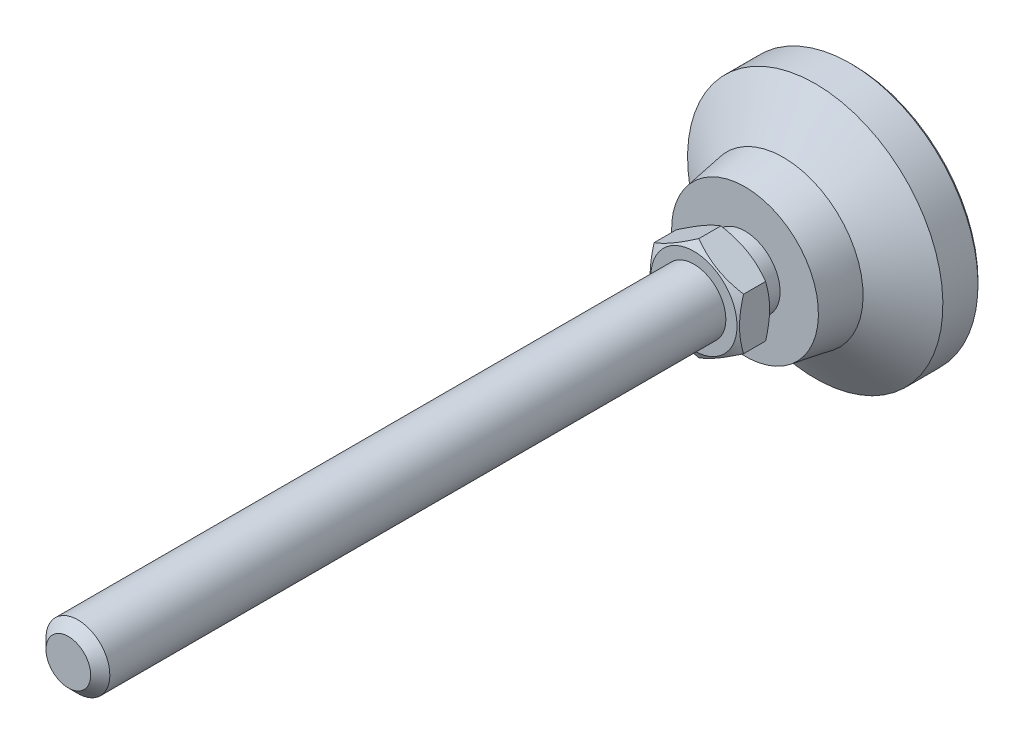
ISO-10303-21;
HEADER;
FILE_DESCRIPTION(('STEP AP214'),'2;1');
FILE_NAME('part.step','',(''),(''),'','','');
FILE_SCHEMA(('AUTOMOTIVE_DESIGN { 1 0 10303 214 1 1 1 1 }'));
ENDSEC;
DATA;
#1=APPLICATION_CONTEXT('core data for automotive mechanical design processes');
#2=APPLICATION_PROTOCOL_DEFINITION('international standard','automotive_design',2000,#1);
#3=PRODUCT_CONTEXT('',#1,'mechanical');
#4=PRODUCT('Part','Part','',(#3));
#5=PRODUCT_RELATED_PRODUCT_CATEGORY('part','',(#4));
#6=PRODUCT_DEFINITION_FORMATION('','',#4);
#7=PRODUCT_DEFINITION_CONTEXT('part definition',#1,'design');
#8=PRODUCT_DEFINITION('design','',#6,#7);
#9=PRODUCT_DEFINITION_SHAPE('','',#8);
#10=(LENGTH_UNIT() NAMED_UNIT(*) SI_UNIT(.MILLI.,.METRE.));
#11=(NAMED_UNIT(*) PLANE_ANGLE_UNIT() SI_UNIT($,.RADIAN.));
#12=(NAMED_UNIT(*) SI_UNIT($,.STERADIAN.) SOLID_ANGLE_UNIT());
#13=UNCERTAINTY_MEASURE_WITH_UNIT(LENGTH_MEASURE(1.E-05),#10,'distance_accuracy_value','');
#14=(GEOMETRIC_REPRESENTATION_CONTEXT(3) GLOBAL_UNCERTAINTY_ASSIGNED_CONTEXT((#13)) GLOBAL_UNIT_ASSIGNED_CONTEXT((#10,
#11,#12)) REPRESENTATION_CONTEXT('',''));
#15=CARTESIAN_POINT('',(0.,0.,0.));
#16=DIRECTION('',(0.,0.,1.));
#17=DIRECTION('',(1.,0.,0.));
#18=AXIS2_PLACEMENT_3D('',#15,#16,#17);
#19=CARTESIAN_POINT('',(0.,0.,-1.00000000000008));
#20=DIRECTION('',(0.,0.,-1.));
#21=DIRECTION('',(0.,1.,0.));
#22=AXIS2_PLACEMENT_3D('',#19,#20,#21);
#23=CYLINDRICAL_SURFACE('',#22,20.);
#24=CARTESIAN_POINT('',(0.,0.,0.500000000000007));
#25=DIRECTION('',(0.,0.,-1.));
#26=DIRECTION('',(0.,1.,0.));
#27=AXIS2_PLACEMENT_3D('',#24,#25,#26);
#28=CIRCLE('',#27,20.);
#29=CARTESIAN_POINT('',(0.,20.,0.500000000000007));
#30=VERTEX_POINT('',#29);
#31=EDGE_CURVE('E114',#30,#30,#28,.F.);
#32=ORIENTED_EDGE('',*,*,#31,.T.);
#33=EDGE_LOOP('',(#32));
#34=FACE_BOUND('',#33,.T.);
#35=CARTESIAN_POINT('',(0.,0.,6.));
#36=DIRECTION('',(0.,0.,-1.));
#37=DIRECTION('',(0.,1.,0.));
#38=AXIS2_PLACEMENT_3D('',#35,#36,#37);
#39=CIRCLE('',#38,20.);
#40=CARTESIAN_POINT('',(0.,20.,6.));
#41=VERTEX_POINT('',#40);
#42=EDGE_CURVE('E108',#41,#41,#39,.T.);
#43=ORIENTED_EDGE('',*,*,#42,.T.);
#44=EDGE_LOOP('',(#43));
#45=FACE_BOUND('',#44,.T.);
#46=ADVANCED_FACE('F14',(#34,#45),#23,.T.);
#47=CARTESIAN_POINT('',(0.,0.,11.));
#48=DIRECTION('',(0.,0.,-1.));
#49=DIRECTION('',(0.,1.,0.));
#50=AXIS2_PLACEMENT_3D('',#47,#48,#49);
#51=CONICAL_SURFACE('',#50,12.5,0.98279372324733);
#52=ORIENTED_EDGE('',*,*,#42,.F.);
#53=EDGE_LOOP('',(#52));
#54=FACE_BOUND('',#53,.T.);
#55=CARTESIAN_POINT('',(0.,0.,11.));
#56=DIRECTION('',(0.,0.,-1.));
#57=DIRECTION('',(0.,1.,0.));
#58=AXIS2_PLACEMENT_3D('',#55,#56,#57);
#59=CIRCLE('',#58,12.5);
#60=CARTESIAN_POINT('',(0.,12.5,11.));
#61=VERTEX_POINT('',#60);
#62=EDGE_CURVE('E105',#61,#61,#59,.T.);
#63=ORIENTED_EDGE('',*,*,#62,.T.);
#64=EDGE_LOOP('',(#63));
#65=FACE_BOUND('',#64,.T.);
#66=ADVANCED_FACE('F225',(#54,#65),#51,.T.);
#67=CARTESIAN_POINT('',(0.,0.,17.));
#68=DIRECTION('',(0.,0.,-1.));
#69=DIRECTION('',(0.,1.,0.));
#70=AXIS2_PLACEMENT_3D('',#67,#68,#69);
#71=CONICAL_SURFACE('',#70,11.5,0.165148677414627);
#72=ORIENTED_EDGE('',*,*,#62,.F.);
#73=EDGE_LOOP('',(#72));
#74=FACE_BOUND('',#73,.T.);
#75=CARTESIAN_POINT('',(0.,0.,17.));
#76=DIRECTION('',(0.,0.,-1.));
#77=DIRECTION('',(0.,1.,0.));
#78=AXIS2_PLACEMENT_3D('',#75,#76,#77);
#79=CIRCLE('',#78,11.5);
#80=CARTESIAN_POINT('',(0.,11.5,17.));
#81=VERTEX_POINT('',#80);
#82=EDGE_CURVE('E102',#81,#81,#79,.T.);
#83=ORIENTED_EDGE('',*,*,#82,.T.);
#84=EDGE_LOOP('',(#83));
#85=FACE_BOUND('',#84,.T.);
#86=ADVANCED_FACE('F221',(#74,#85),#71,.T.);
#87=CARTESIAN_POINT('',(-11.5,0.,17.));
#88=DIRECTION('',(0.,0.,-1.));
#89=DIRECTION('',(0.,1.,0.));
#90=AXIS2_PLACEMENT_3D('',#87,#88,#89);
#91=PLANE('',#90);
#92=ORIENTED_EDGE('',*,*,#82,.F.);
#93=EDGE_LOOP('',(#92));
#94=FACE_BOUND('',#93,.T.);
#95=CARTESIAN_POINT('',(0.,0.,17.));
#96=DIRECTION('',(0.,0.,-1.));
#97=DIRECTION('',(0.,1.,0.));
#98=AXIS2_PLACEMENT_3D('',#95,#96,#97);
#99=CIRCLE('',#98,5.49999999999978);
#100=CARTESIAN_POINT('',(0.,5.49999999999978,17.));
#101=VERTEX_POINT('',#100);
#102=EDGE_CURVE('E99',#101,#101,#99,.T.);
#103=ORIENTED_EDGE('',*,*,#102,.T.);
#104=EDGE_LOOP('',(#103));
#105=FACE_BOUND('',#104,.T.);
#106=ADVANCED_FACE('F217',(#94,#105),#91,.F.);
#107=CARTESIAN_POINT('',(0.,0.,-1.00000000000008));
#108=DIRECTION('',(0.,0.,-1.));
#109=DIRECTION('',(0.,1.,0.));
#110=AXIS2_PLACEMENT_3D('',#107,#108,#109);
#111=CYLINDRICAL_SURFACE('',#110,5.49999999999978);
#112=ORIENTED_EDGE('',*,*,#102,.F.);
#113=EDGE_LOOP('',(#112));
#114=FACE_BOUND('',#113,.T.);
#115=CARTESIAN_POINT('',(0.,0.,20.));
#116=DIRECTION('',(0.,0.,-1.));
#117=DIRECTION('',(0.,1.,0.));
#118=AXIS2_PLACEMENT_3D('',#115,#116,#117);
#119=CIRCLE('',#118,5.49999999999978);
#120=CARTESIAN_POINT('',(0.,5.49999999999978,20.));
#121=VERTEX_POINT('',#120);
#122=EDGE_CURVE('E96',#121,#121,#119,.T.);
#123=ORIENTED_EDGE('',*,*,#122,.T.);
#124=EDGE_LOOP('',(#123));
#125=FACE_BOUND('',#124,.T.);
#126=ADVANCED_FACE('F213',(#114,#125),#111,.T.);
#127=CARTESIAN_POINT('',(-5.49999999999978,0.,20.));
#128=DIRECTION('',(0.,0.,1.));
#129=DIRECTION('',(0.,-1.,0.));
#130=AXIS2_PLACEMENT_3D('',#127,#128,#129);
#131=PLANE('',#130);
#132=CARTESIAN_POINT('',(0.,0.,20.));
#133=DIRECTION('',(0.,0.,1.));
#134=DIRECTION('',(0.,-1.,0.));
#135=AXIS2_PLACEMENT_3D('',#132,#133,#134);
#136=CIRCLE('',#135,6.75);
#137=CARTESIAN_POINT('',(0.,-6.75,20.));
#138=VERTEX_POINT('',#137);
#139=EDGE_CURVE('E419',#138,#138,#136,.T.);
#140=ORIENTED_EDGE('',*,*,#139,.F.);
#141=EDGE_LOOP('',(#140));
#142=FACE_BOUND('',#141,.T.);
#143=ORIENTED_EDGE('',*,*,#122,.F.);
#144=EDGE_LOOP('',(#143));
#145=FACE_BOUND('',#144,.T.);
#146=ADVANCED_FACE('F210',(#142,#145),#131,.F.);
#147=CARTESIAN_POINT('',(0.,0.,0.));
#148=DIRECTION('',(0.,0.,-1.));
#149=DIRECTION('',(0.,1.,0.));
#150=AXIS2_PLACEMENT_3D('',#147,#148,#149);
#151=PLANE('',#150);
#152=CARTESIAN_POINT('',(0.,0.,0.));
#153=DIRECTION('',(0.,0.,-1.));
#154=DIRECTION('',(0.,1.,0.));
#155=AXIS2_PLACEMENT_3D('',#152,#153,#154);
#156=CIRCLE('',#155,19.5);
#157=CARTESIAN_POINT('',(0.,19.5,0.));
#158=VERTEX_POINT('',#157);
#159=EDGE_CURVE('E111',#158,#158,#156,.T.);
#160=ORIENTED_EDGE('',*,*,#159,.T.);
#161=EDGE_LOOP('',(#160));
#162=FACE_BOUND('',#161,.T.);
#163=ADVANCED_FACE('F183',(#162),#151,.T.);
#164=CARTESIAN_POINT('',(0.,0.,0.));
#165=DIRECTION('',(0.,0.,1.));
#166=DIRECTION('',(0.,-1.,0.));
#167=AXIS2_PLACEMENT_3D('',#164,#165,#166);
#168=CONICAL_SURFACE('',#167,19.5,0.785398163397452);
#169=ORIENTED_EDGE('',*,*,#31,.F.);
#170=EDGE_LOOP('',(#169));
#171=FACE_BOUND('',#170,.T.);
#172=ORIENTED_EDGE('',*,*,#159,.F.);
#173=EDGE_LOOP('',(#172));
#174=FACE_BOUND('',#173,.T.);
#175=ADVANCED_FACE('F16',(#171,#174),#168,.T.);
#176=CARTESIAN_POINT('',(0.,0.,20.));
#177=DIRECTION('',(0.,0.,1.));
#178=DIRECTION('',(0.,-1.,0.));
#179=AXIS2_PLACEMENT_3D('',#176,#177,#178);
#180=CONICAL_SURFACE('',#179,6.75,1.0471975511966);
#181=CARTESIAN_POINT('',(0.000200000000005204,-8.08301923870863,20.7696190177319));
#182=CARTESIAN_POINT('',(-0.153667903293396,-7.99418356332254,20.7183374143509));
#183=CARTESIAN_POINT('',(-0.308109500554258,-7.90501666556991,20.669383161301));
#184=CARTESIAN_POINT('',(-0.618246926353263,-7.72595873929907,20.5767703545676));
#185=CARTESIAN_POINT('',(-0.773943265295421,-7.63606741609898,20.5331140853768));
#186=CARTESIAN_POINT('',(-1.24352516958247,-7.36495417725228,20.4109491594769));
#187=CARTESIAN_POINT('',(-1.55926433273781,-7.18266208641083,20.3414631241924));
#188=CARTESIAN_POINT('',(-2.03176224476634,-6.90986528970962,20.2599825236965));
#189=CARTESIAN_POINT('',(-2.1871092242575,-6.82017566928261,20.2367710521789));
#190=CARTESIAN_POINT('',(-2.49850511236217,-6.64039116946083,20.1978487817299));
#191=CARTESIAN_POINT('',(-2.65455395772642,-6.55029632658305,20.1821373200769));
#192=CARTESIAN_POINT('',(-2.96692267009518,-6.36995016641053,20.1586154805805));
#193=CARTESIAN_POINT('',(-3.12324202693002,-6.27969914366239,20.1507961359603));
#194=CARTESIAN_POINT('',(-3.43601650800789,-6.09911871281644,20.1432178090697));
#195=CARTESIAN_POINT('',(-3.59247162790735,-6.00878930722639,20.1434585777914));
#196=CARTESIAN_POINT('',(-4.02110687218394,-5.76131663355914,20.1551972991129));
#197=CARTESIAN_POINT('',(-4.2931466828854,-5.60425437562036,20.1749033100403));
#198=CARTESIAN_POINT('',(-4.83541944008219,-5.29117305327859,20.2373910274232));
#199=CARTESIAN_POINT('',(-5.10565047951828,-5.13515508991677,20.2801940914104));
#200=CARTESIAN_POINT('',(-5.64901454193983,-4.82144370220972,20.3871892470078));
#201=CARTESIAN_POINT('',(-5.92207900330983,-4.66378986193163,20.4518346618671));
#202=CARTESIAN_POINT('',(-6.46413578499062,-4.35083323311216,20.5985536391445));
#203=CARTESIAN_POINT('',(-6.73313504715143,-4.19552643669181,20.680592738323));
#204=CARTESIAN_POINT('',(-7.0002,-4.04133641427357,20.7696190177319));
#205=B_SPLINE_CURVE_WITH_KNOTS('',3,(#181,#182,#183,#184,#185,#186,#187,#188,#189,#190,#191,
#192,#193,#194,#195,#196,#197,#198,#199,#200,#201,#202,#203,#204),.UNSPECIFIED.,.F.,.F.,(4,2,2,
2,2,2,2,2,2,2,2,4),(0.,0.554727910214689,1.10969417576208,2.2219327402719,2.76443041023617,
3.30688013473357,3.8487128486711,4.39052882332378,5.33376515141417,6.27787517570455,
7.24292418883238,8.20607866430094),.UNSPECIFIED.);
#206=CARTESIAN_POINT('',(0.,-8.08290376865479,20.7695523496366));
#207=VERTEX_POINT('',#206);
#208=CARTESIAN_POINT('',(-7.,-4.04145188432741,20.7695523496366));
#209=VERTEX_POINT('',#208);
#210=EDGE_CURVE('E73',#207,#209,#205,.T.);
#211=ORIENTED_EDGE('',*,*,#210,.T.);
#212=CARTESIAN_POINT('',(-7.,10.8202529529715,23.5432681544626));
#213=CARTESIAN_POINT('',(-7.,10.5148124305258,23.3952455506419));
#214=CARTESIAN_POINT('',(-7.,10.2086669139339,23.2486525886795));
#215=CARTESIAN_POINT('',(-7.,9.5945908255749,22.9591307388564));
#216=CARTESIAN_POINT('',(-7.,9.28665997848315,22.8162024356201));
#217=CARTESIAN_POINT('',(-7.,8.66703448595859,22.5340880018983));
#218=CARTESIAN_POINT('',(-7.,8.35532845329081,22.3949267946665));
#219=CARTESIAN_POINT('',(-7.,7.72942473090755,22.122347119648));
#220=CARTESIAN_POINT('',(-7.,7.41522716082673,21.9889283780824));
#221=CARTESIAN_POINT('',(-7.,6.77383911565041,21.7252392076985));
#222=CARTESIAN_POINT('',(-7.,6.44655217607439,21.5952021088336));
#223=CARTESIAN_POINT('',(-7.,5.78813694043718,21.3450560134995));
#224=CARTESIAN_POINT('',(-7.,5.45700821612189,21.2249481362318));
#225=CARTESIAN_POINT('',(-7.,4.7910099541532,20.9978400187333));
#226=CARTESIAN_POINT('',(-7.,4.45614967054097,20.8908129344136));
#227=CARTESIAN_POINT('',(-7.,3.78163812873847,20.6933226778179));
#228=CARTESIAN_POINT('',(-7.,3.44198842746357,20.6028542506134));
#229=CARTESIAN_POINT('',(-7.,2.75952563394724,20.4433313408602));
#230=CARTESIAN_POINT('',(-7.,2.41674010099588,20.3741621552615));
#231=CARTESIAN_POINT('',(-7.,1.89946895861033,20.2893953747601));
#232=CARTESIAN_POINT('',(-7.,1.72651680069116,20.2643031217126));
#233=CARTESIAN_POINT('',(-7.,1.37976497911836,20.2209405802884));
#234=CARTESIAN_POINT('',(-7.,1.20596539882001,20.2026696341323));
#235=CARTESIAN_POINT('',(-7.,0.860006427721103,20.1735410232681));
#236=CARTESIAN_POINT('',(-7.,0.6878548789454,20.1625905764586));
#237=CARTESIAN_POINT('',(-7.,0.343243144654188,20.1479769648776));
#238=CARTESIAN_POINT('',(-7.,0.170782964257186,20.1443136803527));
#239=CARTESIAN_POINT('',(-7.,-0.174138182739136,20.1443616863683));
#240=CARTESIAN_POINT('',(-7.,-0.346599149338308,20.1480730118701));
#241=CARTESIAN_POINT('',(-7.,-0.691212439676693,20.1627801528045));
#242=CARTESIAN_POINT('',(-7.,-0.863364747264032,20.1737763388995));
#243=CARTESIAN_POINT('',(-7.,-1.27818303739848,20.2088182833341));
#244=CARTESIAN_POINT('',(-7.,-1.52055810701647,20.2363806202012));
#245=CARTESIAN_POINT('',(-7.,-2.00347448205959,20.3044333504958));
#246=CARTESIAN_POINT('',(-7.,-2.24401552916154,20.3449255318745));
#247=CARTESIAN_POINT('',(-7.,-2.9626321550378,20.4836467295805));
#248=CARTESIAN_POINT('',(-7.,-3.43742594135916,20.5990941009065));
#249=CARTESIAN_POINT('',(-7.,-4.14732411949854,20.7988525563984));
#250=CARTESIAN_POINT('',(-7.,-4.38612167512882,20.8707900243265));
#251=CARTESIAN_POINT('',(-7.,-4.86139665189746,21.0220275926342));
#252=CARTESIAN_POINT('',(-7.,-5.09787405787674,21.1013277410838));
#253=CARTESIAN_POINT('',(-7.,-5.5685852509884,21.2660273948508));
#254=CARTESIAN_POINT('',(-7.,-5.80281977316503,21.3514248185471));
#255=CARTESIAN_POINT('',(-7.,-6.2693554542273,21.5273251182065));
#256=CARTESIAN_POINT('',(-7.,-6.50165663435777,21.6178279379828));
#257=CARTESIAN_POINT('',(-7.,-7.04414967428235,21.8349510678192));
#258=CARTESIAN_POINT('',(-7.,-7.35365307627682,21.9632882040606));
#259=CARTESIAN_POINT('',(-7.,-7.97007793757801,22.2260376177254));
#260=CARTESIAN_POINT('',(-7.,-8.27699924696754,22.3604502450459));
#261=CARTESIAN_POINT('',(-7.,-8.88872735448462,22.6341465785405));
#262=CARTESIAN_POINT('',(-7.,-9.19353373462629,22.7734312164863));
#263=CARTESIAN_POINT('',(-7.,-9.80133281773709,23.0559098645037));
#264=CARTESIAN_POINT('',(-7.,-10.1043254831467,23.1991039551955));
#265=CARTESIAN_POINT('',(-7.,-10.7090957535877,23.4888231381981));
#266=CARTESIAN_POINT('',(-7.,-11.0108717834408,23.6353515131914));
#267=CARTESIAN_POINT('',(-7.,-11.6131345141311,23.9310368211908));
#268=CARTESIAN_POINT('',(-7.,-11.913621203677,24.0801937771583));
#269=CARTESIAN_POINT('',(-7.,-12.8133753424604,24.5308785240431));
#270=CARTESIAN_POINT('',(-7.,-13.4110141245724,24.8356575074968));
#271=CARTESIAN_POINT('',(-7.,-14.5540747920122,25.4260053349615));
#272=CARTESIAN_POINT('',(-7.,-15.0997470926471,25.7110914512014));
#273=CARTESIAN_POINT('',(-7.,-16.1890597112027,26.2851610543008));
#274=CARTESIAN_POINT('',(-7.,-16.7326999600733,26.5741446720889));
#275=CARTESIAN_POINT('',(-7.,-17.8170812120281,27.1543850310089));
#276=CARTESIAN_POINT('',(-7.,-18.3578260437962,27.4456346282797));
#277=CARTESIAN_POINT('',(-7.,-19.4380132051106,28.0304716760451));
#278=CARTESIAN_POINT('',(-7.,-19.9774556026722,28.3240590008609));
#279=CARTESIAN_POINT('',(-7.,-20.5164170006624,28.6185207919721));
#280=B_SPLINE_CURVE_WITH_KNOTS('',3,(#212,#213,#214,#215,#216,#217,#218,#219,#220,#221,#222,
#223,#224,#225,#226,#227,#228,#229,#230,#231,#232,#233,#234,#235,#236,#237,#238,#239,#240,#241,
#242,#243,#244,#245,#246,#247,#248,#249,#250,#251,#252,#253,#254,#255,#256,#257,#258,#259,#260,
#261,#262,#263,#264,#265,#266,#267,#268,#269,#270,#271,#272,#273,#274,#275,#276,#277,#278,#279),
.UNSPECIFIED.,.F.,.F.,(4,2,2,2,2,2,2,2,2,2,2,2,2,2,2,2,2,2,2,2,2,2,2,2,2,2,2,2,2,2,2,2,2,4),(0.,
1.01826671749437,2.03669488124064,3.06072779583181,4.08471183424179,5.14110826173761,
6.19762360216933,7.25193302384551,8.30590727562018,9.35410206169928,9.87827738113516,
10.402402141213,10.9197512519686,11.4370918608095,11.954434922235,12.4718043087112,
13.2032018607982,13.9347005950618,15.3985239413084,16.1466563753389,16.8947936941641,
17.6426768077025,18.3905516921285,19.3956339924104,20.4007742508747,21.4061078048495,
22.4114621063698,23.4178531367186,24.4242529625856,26.436795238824,28.2837465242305,
30.1307600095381,31.9733286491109,33.8157988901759),.UNSPECIFIED.);
#281=CARTESIAN_POINT('',(-7.,4.04145188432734,20.7695523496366));
#282=VERTEX_POINT('',#281);
#283=EDGE_CURVE('E81',#209,#282,#280,.F.);
#284=ORIENTED_EDGE('',*,*,#283,.T.);
#285=CARTESIAN_POINT('',(-7.0002,4.0413364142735,20.7696190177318));
#286=CARTESIAN_POINT('',(-6.8463320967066,4.13017208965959,20.7183374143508));
#287=CARTESIAN_POINT('',(-6.69189049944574,4.21933898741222,20.669383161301));
#288=CARTESIAN_POINT('',(-6.38175307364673,4.39839691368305,20.5767703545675));
#289=CARTESIAN_POINT('',(-6.22605673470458,4.48828823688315,20.5331140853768));
#290=CARTESIAN_POINT('',(-5.75647483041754,4.75940147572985,20.4109491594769));
#291=CARTESIAN_POINT('',(-5.4407356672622,4.94169356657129,20.3414631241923));
#292=CARTESIAN_POINT('',(-4.96823775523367,5.2144903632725,20.2599825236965));
#293=CARTESIAN_POINT('',(-4.81289077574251,5.30417998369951,20.2367710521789));
#294=CARTESIAN_POINT('',(-4.50149488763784,5.48396448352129,20.1978487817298));
#295=CARTESIAN_POINT('',(-4.34544604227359,5.57405932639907,20.1821373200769));
#296=CARTESIAN_POINT('',(-4.03307732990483,5.75440548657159,20.1586154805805));
#297=CARTESIAN_POINT('',(-3.87675797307,5.84465650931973,20.1507961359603));
#298=CARTESIAN_POINT('',(-3.56398349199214,6.02523694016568,20.1432178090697));
#299=CARTESIAN_POINT('',(-3.40752837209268,6.11556634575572,20.1434585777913));
#300=CARTESIAN_POINT('',(-2.97889312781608,6.36303901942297,20.1551972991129));
#301=CARTESIAN_POINT('',(-2.70685331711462,6.52010127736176,20.1749033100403));
#302=CARTESIAN_POINT('',(-2.16458055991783,6.83318259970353,20.2373910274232));
#303=CARTESIAN_POINT('',(-1.89434952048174,6.98920056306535,20.2801940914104));
#304=CARTESIAN_POINT('',(-1.35098545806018,7.3029119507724,20.3871892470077));
#305=CARTESIAN_POINT('',(-1.07792099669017,7.4605657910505,20.451834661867));
#306=CARTESIAN_POINT('',(-0.535864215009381,7.77352241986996,20.5985536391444));
#307=CARTESIAN_POINT('',(-0.266864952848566,7.92882921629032,20.6805927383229));
#308=CARTESIAN_POINT('',(0.000200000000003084,8.08301923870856,20.7696190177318));
#309=B_SPLINE_CURVE_WITH_KNOTS('',3,(#285,#286,#287,#288,#289,#290,#291,#292,#293,#294,#295,
#296,#297,#298,#299,#300,#301,#302,#303,#304,#305,#306,#307,#308),.UNSPECIFIED.,.F.,.F.,(4,2,2,
2,2,2,2,2,2,2,2,4),(0.,0.554727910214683,1.10969417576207,2.22193274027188,2.76443041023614,
3.30688013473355,3.84871284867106,4.39052882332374,5.33376515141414,6.27787517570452,
7.24292418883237,8.20607866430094),.UNSPECIFIED.);
#310=CARTESIAN_POINT('',(0.,8.08290376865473,20.7695523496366));
#311=VERTEX_POINT('',#310);
#312=EDGE_CURVE('E193',#282,#311,#309,.T.);
#313=ORIENTED_EDGE('',*,*,#312,.T.);
#314=CARTESIAN_POINT('',(-0.000199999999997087,8.08301923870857,20.7696190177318));
#315=CARTESIAN_POINT('',(0.153667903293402,7.99418356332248,20.7183374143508));
#316=CARTESIAN_POINT('',(0.308109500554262,7.90501666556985,20.669383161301));
#317=CARTESIAN_POINT('',(0.618246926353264,7.72595873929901,20.5767703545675));
#318=CARTESIAN_POINT('',(0.773943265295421,7.63606741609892,20.5331140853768));
#319=CARTESIAN_POINT('',(1.24352516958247,7.36495417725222,20.4109491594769));
#320=CARTESIAN_POINT('',(1.5592643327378,7.18266208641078,20.3414631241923));
#321=CARTESIAN_POINT('',(2.03176224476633,6.90986528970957,20.2599825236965));
#322=CARTESIAN_POINT('',(2.18710922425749,6.82017566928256,20.2367710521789));
#323=CARTESIAN_POINT('',(2.49850511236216,6.64039116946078,20.1978487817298));
#324=CARTESIAN_POINT('',(2.65455395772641,6.550296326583,20.1821373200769));
#325=CARTESIAN_POINT('',(2.96692267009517,6.36995016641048,20.1586154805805));
#326=CARTESIAN_POINT('',(3.12324202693,6.27969914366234,20.1507961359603));
#327=CARTESIAN_POINT('',(3.43601650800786,6.09911871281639,20.1432178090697));
#328=CARTESIAN_POINT('',(3.59247162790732,6.00878930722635,20.1434585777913));
#329=CARTESIAN_POINT('',(4.02110687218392,5.7613166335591,20.1551972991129));
#330=CARTESIAN_POINT('',(4.29314668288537,5.60425437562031,20.1749033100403));
#331=CARTESIAN_POINT('',(4.83541944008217,5.29117305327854,20.2373910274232));
#332=CARTESIAN_POINT('',(5.10565047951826,5.13515508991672,20.2801940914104));
#333=CARTESIAN_POINT('',(5.64901454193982,4.82144370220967,20.3871892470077));
#334=CARTESIAN_POINT('',(5.92207900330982,4.66378986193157,20.4518346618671));
#335=CARTESIAN_POINT('',(6.46413578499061,4.35083323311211,20.5985536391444));
#336=CARTESIAN_POINT('',(6.73313504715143,4.19552643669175,20.6805927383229));
#337=CARTESIAN_POINT('',(7.0002,4.04133641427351,20.7696190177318));
#338=B_SPLINE_CURVE_WITH_KNOTS('',3,(#314,#315,#316,#317,#318,#319,#320,#321,#322,#323,#324,
#325,#326,#327,#328,#329,#330,#331,#332,#333,#334,#335,#336,#337),.UNSPECIFIED.,.F.,.F.,(4,2,2,
2,2,2,2,2,2,2,2,4),(0.,0.554727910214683,1.10969417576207,2.22193274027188,2.76443041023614,
3.30688013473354,3.84871284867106,4.39052882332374,5.33376515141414,6.27787517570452,
7.24292418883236,8.20607866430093),.UNSPECIFIED.);
#339=CARTESIAN_POINT('',(7.,4.04145188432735,20.7695523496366));
#340=VERTEX_POINT('',#339);
#341=EDGE_CURVE('E403',#311,#340,#338,.T.);
#342=ORIENTED_EDGE('',*,*,#341,.T.);
#343=CARTESIAN_POINT('',(7.,10.8202529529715,23.5432681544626));
#344=CARTESIAN_POINT('',(7.,10.5148124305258,23.3952455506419));
#345=CARTESIAN_POINT('',(7.,10.2086669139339,23.2486525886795));
#346=CARTESIAN_POINT('',(7.,9.5945908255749,22.9591307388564));
#347=CARTESIAN_POINT('',(7.,9.28665997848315,22.8162024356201));
#348=CARTESIAN_POINT('',(7.,8.66703448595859,22.5340880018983));
#349=CARTESIAN_POINT('',(7.,8.35532845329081,22.3949267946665));
#350=CARTESIAN_POINT('',(7.,7.72942473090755,22.122347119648));
#351=CARTESIAN_POINT('',(7.,7.41522716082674,21.9889283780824));
#352=CARTESIAN_POINT('',(7.,6.77383911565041,21.7252392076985));
#353=CARTESIAN_POINT('',(7.,6.44655217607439,21.5952021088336));
#354=CARTESIAN_POINT('',(7.,5.78813694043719,21.3450560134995));
#355=CARTESIAN_POINT('',(7.,5.4570082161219,21.2249481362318));
#356=CARTESIAN_POINT('',(7.,4.7910099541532,20.9978400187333));
#357=CARTESIAN_POINT('',(7.,4.45614967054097,20.8908129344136));
#358=CARTESIAN_POINT('',(7.,3.78163812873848,20.6933226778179));
#359=CARTESIAN_POINT('',(7.,3.44198842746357,20.6028542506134));
#360=CARTESIAN_POINT('',(7.,2.75952563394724,20.4433313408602));
#361=CARTESIAN_POINT('',(7.,2.41674010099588,20.3741621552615));
#362=CARTESIAN_POINT('',(7.,1.89946895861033,20.2893953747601));
#363=CARTESIAN_POINT('',(7.,1.72651680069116,20.2643031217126));
#364=CARTESIAN_POINT('',(7.,1.37976497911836,20.2209405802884));
#365=CARTESIAN_POINT('',(7.,1.20596539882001,20.2026696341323));
#366=CARTESIAN_POINT('',(7.,0.860006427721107,20.1735410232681));
#367=CARTESIAN_POINT('',(7.,0.687854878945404,20.1625905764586));
#368=CARTESIAN_POINT('',(7.,0.343243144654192,20.1479769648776));
#369=CARTESIAN_POINT('',(7.,0.17078296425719,20.1443136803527));
#370=CARTESIAN_POINT('',(7.,-0.174138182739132,20.1443616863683));
#371=CARTESIAN_POINT('',(7.,-0.346599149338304,20.1480730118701));
#372=CARTESIAN_POINT('',(7.,-0.69121243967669,20.1627801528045));
#373=CARTESIAN_POINT('',(7.,-0.86336474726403,20.1737763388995));
#374=CARTESIAN_POINT('',(7.,-1.27818303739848,20.2088182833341));
#375=CARTESIAN_POINT('',(7.,-1.52055810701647,20.2363806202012));
#376=CARTESIAN_POINT('',(7.,-2.00347448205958,20.3044333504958));
#377=CARTESIAN_POINT('',(7.,-2.24401552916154,20.3449255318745));
#378=CARTESIAN_POINT('',(7.,-2.9626321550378,20.4836467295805));
#379=CARTESIAN_POINT('',(7.,-3.43742594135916,20.5990941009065));
#380=CARTESIAN_POINT('',(7.,-4.14732411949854,20.7988525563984));
#381=CARTESIAN_POINT('',(7.,-4.38612167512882,20.8707900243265));
#382=CARTESIAN_POINT('',(7.,-4.86139665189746,21.0220275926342));
#383=CARTESIAN_POINT('',(7.,-5.09787405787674,21.1013277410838));
#384=CARTESIAN_POINT('',(7.,-5.5685852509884,21.2660273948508));
#385=CARTESIAN_POINT('',(7.,-5.80281977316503,21.3514248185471));
#386=CARTESIAN_POINT('',(7.,-6.2693554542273,21.5273251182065));
#387=CARTESIAN_POINT('',(7.,-6.50165663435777,21.6178279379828));
#388=CARTESIAN_POINT('',(7.,-7.04414967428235,21.8349510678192));
#389=CARTESIAN_POINT('',(7.,-7.35365307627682,21.9632882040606));
#390=CARTESIAN_POINT('',(7.,-7.97007793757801,22.2260376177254));
#391=CARTESIAN_POINT('',(7.,-8.27699924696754,22.3604502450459));
#392=CARTESIAN_POINT('',(7.,-8.88872735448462,22.6341465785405));
#393=CARTESIAN_POINT('',(7.,-9.19353373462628,22.7734312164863));
#394=CARTESIAN_POINT('',(7.,-9.80133281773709,23.0559098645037));
#395=CARTESIAN_POINT('',(7.,-10.1043254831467,23.1991039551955));
#396=CARTESIAN_POINT('',(7.,-10.7090957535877,23.4888231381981));
#397=CARTESIAN_POINT('',(7.,-11.0108717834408,23.6353515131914));
#398=CARTESIAN_POINT('',(7.,-11.6131345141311,23.9310368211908));
#399=CARTESIAN_POINT('',(7.,-11.913621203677,24.0801937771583));
#400=CARTESIAN_POINT('',(7.,-12.8133753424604,24.5308785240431));
#401=CARTESIAN_POINT('',(7.,-13.4110141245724,24.8356575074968));
#402=CARTESIAN_POINT('',(7.,-14.5540747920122,25.4260053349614));
#403=CARTESIAN_POINT('',(7.,-15.0997470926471,25.7110914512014));
#404=CARTESIAN_POINT('',(7.,-16.1890597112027,26.2851610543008));
#405=CARTESIAN_POINT('',(7.,-16.7326999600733,26.5741446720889));
#406=CARTESIAN_POINT('',(7.,-17.8170812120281,27.1543850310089));
#407=CARTESIAN_POINT('',(7.,-18.3578260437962,27.4456346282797));
#408=CARTESIAN_POINT('',(7.,-19.4380132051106,28.0304716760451));
#409=CARTESIAN_POINT('',(7.,-19.9774556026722,28.3240590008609));
#410=CARTESIAN_POINT('',(7.,-20.5164170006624,28.6185207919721));
#411=B_SPLINE_CURVE_WITH_KNOTS('',3,(#343,#344,#345,#346,#347,#348,#349,#350,#351,#352,#353,
#354,#355,#356,#357,#358,#359,#360,#361,#362,#363,#364,#365,#366,#367,#368,#369,#370,#371,#372,
#373,#374,#375,#376,#377,#378,#379,#380,#381,#382,#383,#384,#385,#386,#387,#388,#389,#390,#391,
#392,#393,#394,#395,#396,#397,#398,#399,#400,#401,#402,#403,#404,#405,#406,#407,#408,#409,#410),
.UNSPECIFIED.,.F.,.F.,(4,2,2,2,2,2,2,2,2,2,2,2,2,2,2,2,2,2,2,2,2,2,2,2,2,2,2,2,2,2,2,2,2,4),(0.,
1.01826671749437,2.03669488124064,3.06072779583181,4.08471183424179,5.14110826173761,
6.19762360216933,7.25193302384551,8.30590727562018,9.35410206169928,9.87827738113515,
10.402402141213,10.9197512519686,11.4370918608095,11.954434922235,12.4718043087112,
13.2032018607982,13.9347005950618,15.3985239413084,16.1466563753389,16.8947936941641,
17.6426768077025,18.3905516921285,19.3956339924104,20.4007742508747,21.4061078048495,
22.4114621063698,23.4178531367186,24.4242529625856,26.436795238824,28.2837465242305,
30.1307600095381,31.9733286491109,33.8157988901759),.UNSPECIFIED.);
#412=CARTESIAN_POINT('',(7.,-4.04145188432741,20.7695523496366));
#413=VERTEX_POINT('',#412);
#414=EDGE_CURVE('E34',#340,#413,#411,.T.);
#415=ORIENTED_EDGE('',*,*,#414,.T.);
#416=CARTESIAN_POINT('',(7.0002,-4.04133641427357,20.7696190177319));
#417=CARTESIAN_POINT('',(6.8463320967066,-4.13017208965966,20.7183374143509));
#418=CARTESIAN_POINT('',(6.69189049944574,-4.2193389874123,20.669383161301));
#419=CARTESIAN_POINT('',(6.38175307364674,-4.39839691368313,20.5767703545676));
#420=CARTESIAN_POINT('',(6.22605673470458,-4.48828823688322,20.5331140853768));
#421=CARTESIAN_POINT('',(5.75647483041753,-4.75940147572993,20.4109491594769));
#422=CARTESIAN_POINT('',(5.44073566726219,-4.94169356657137,20.3414631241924));
#423=CARTESIAN_POINT('',(4.96823775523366,-5.21449036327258,20.2599825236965));
#424=CARTESIAN_POINT('',(4.8128907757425,-5.30417998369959,20.2367710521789));
#425=CARTESIAN_POINT('',(4.50149488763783,-5.48396448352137,20.1978487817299));
#426=CARTESIAN_POINT('',(4.34544604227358,-5.57405932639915,20.1821373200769));
#427=CARTESIAN_POINT('',(4.03307732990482,-5.75440548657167,20.1586154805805));
#428=CARTESIAN_POINT('',(3.87675797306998,-5.84465650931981,20.1507961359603));
#429=CARTESIAN_POINT('',(3.56398349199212,-6.02523694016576,20.1432178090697));
#430=CARTESIAN_POINT('',(3.40752837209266,-6.11556634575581,20.1434585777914));
#431=CARTESIAN_POINT('',(2.97889312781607,-6.36303901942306,20.1551972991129));
#432=CARTESIAN_POINT('',(2.70685331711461,-6.52010127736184,20.1749033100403));
#433=CARTESIAN_POINT('',(2.16458055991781,-6.83318259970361,20.2373910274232));
#434=CARTESIAN_POINT('',(1.89434952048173,-6.98920056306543,20.2801940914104));
#435=CARTESIAN_POINT('',(1.35098545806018,-7.30291195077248,20.3871892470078));
#436=CARTESIAN_POINT('',(1.07792099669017,-7.46056579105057,20.4518346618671));
#437=CARTESIAN_POINT('',(0.535864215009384,-7.77352241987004,20.5985536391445));
#438=CARTESIAN_POINT('',(0.266864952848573,-7.92882921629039,20.680592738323));
#439=CARTESIAN_POINT('',(-0.000199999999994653,-8.08301923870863,20.7696190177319));
#440=B_SPLINE_CURVE_WITH_KNOTS('',3,(#416,#417,#418,#419,#420,#421,#422,#423,#424,#425,#426,
#427,#428,#429,#430,#431,#432,#433,#434,#435,#436,#437,#438,#439),.UNSPECIFIED.,.F.,.F.,(4,2,2,
2,2,2,2,2,2,2,2,4),(0.,0.554727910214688,1.10969417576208,2.22193274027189,2.76443041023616,
3.30688013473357,3.84871284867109,4.39052882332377,5.33376515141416,6.27787517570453,
7.24292418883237,8.20607866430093),.UNSPECIFIED.);
#441=EDGE_CURVE('E9',#413,#207,#440,.T.);
#442=ORIENTED_EDGE('',*,*,#441,.T.);
#443=EDGE_LOOP('',(#211,#284,#313,#342,#415,#442));
#444=FACE_BOUND('',#443,.T.);
#445=ORIENTED_EDGE('',*,*,#139,.T.);
#446=EDGE_LOOP('',(#445));
#447=FACE_BOUND('',#446,.T.);
#448=ADVANCED_FACE('F71',(#444,#447),#180,.T.);
#449=CARTESIAN_POINT('',(0.,0.,123.));
#450=DIRECTION('',(0.,0.,-1.));
#451=DIRECTION('',(0.,1.,0.));
#452=AXIS2_PLACEMENT_3D('',#449,#450,#451);
#453=PLANE('',#452);
#454=CARTESIAN_POINT('',(0.,0.,123.));
#455=DIRECTION('',(0.,0.,-1.));
#456=DIRECTION('',(0.,1.,0.));
#457=AXIS2_PLACEMENT_3D('',#454,#455,#456);
#458=CIRCLE('',#457,3.5);
#459=CARTESIAN_POINT('',(0.,3.5,123.));
#460=VERTEX_POINT('',#459);
#461=EDGE_CURVE('E87',#460,#460,#458,.T.);
#462=ORIENTED_EDGE('',*,*,#461,.F.);
#463=EDGE_LOOP('',(#462));
#464=FACE_BOUND('',#463,.T.);
#465=ADVANCED_FACE('F274',(#464),#453,.F.);
#466=CARTESIAN_POINT('',(0.,0.,123.));
#467=DIRECTION('',(0.,0.,-1.));
#468=DIRECTION('',(0.,1.,0.));
#469=AXIS2_PLACEMENT_3D('',#466,#467,#468);
#470=CONICAL_SURFACE('',#469,3.5,0.785398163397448);
#471=CARTESIAN_POINT('',(0.,0.,121.5));
#472=DIRECTION('',(0.,0.,-1.));
#473=DIRECTION('',(0.,1.,0.));
#474=AXIS2_PLACEMENT_3D('',#471,#472,#473);
#475=CIRCLE('',#474,5.);
#476=CARTESIAN_POINT('',(0.,5.,121.5));
#477=VERTEX_POINT('',#476);
#478=EDGE_CURVE('E92',#477,#477,#475,.T.);
#479=ORIENTED_EDGE('',*,*,#478,.F.);
#480=EDGE_LOOP('',(#479));
#481=FACE_BOUND('',#480,.T.);
#482=ORIENTED_EDGE('',*,*,#461,.T.);
#483=EDGE_LOOP('',(#482));
#484=FACE_BOUND('',#483,.T.);
#485=ADVANCED_FACE('F281',(#481,#484),#470,.T.);
#486=CARTESIAN_POINT('',(0.,0.,-7.74975615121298));
#487=DIRECTION('',(0.,0.,-1.));
#488=DIRECTION('',(0.,1.,0.));
#489=AXIS2_PLACEMENT_3D('',#486,#487,#488);
#490=CYLINDRICAL_SURFACE('',#489,5.);
#491=CARTESIAN_POINT('',(0.,0.,25.));
#492=DIRECTION('',(0.,0.,-1.));
#493=DIRECTION('',(0.,1.,0.));
#494=AXIS2_PLACEMENT_3D('',#491,#492,#493);
#495=CIRCLE('',#494,5.);
#496=CARTESIAN_POINT('',(0.,5.,25.));
#497=VERTEX_POINT('',#496);
#498=EDGE_CURVE('E117',#497,#497,#495,.F.);
#499=ORIENTED_EDGE('',*,*,#498,.T.);
#500=EDGE_LOOP('',(#499));
#501=FACE_BOUND('',#500,.T.);
#502=ORIENTED_EDGE('',*,*,#478,.T.);
#503=EDGE_LOOP('',(#502));
#504=FACE_BOUND('',#503,.T.);
#505=ADVANCED_FACE('F134',(#501,#504),#490,.T.);
#506=CARTESIAN_POINT('',(-3.99999999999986,0.,25.));
#507=DIRECTION('',(0.,0.,-1.));
#508=DIRECTION('',(0.,1.,0.));
#509=AXIS2_PLACEMENT_3D('',#506,#507,#508);
#510=PLANE('',#509);
#511=CARTESIAN_POINT('',(0.,0.,25.));
#512=DIRECTION('',(0.,0.,1.));
#513=DIRECTION('',(0.,-1.,0.));
#514=AXIS2_PLACEMENT_3D('',#511,#512,#513);
#515=CIRCLE('',#514,6.75);
#516=CARTESIAN_POINT('',(0.,-6.75,25.));
#517=VERTEX_POINT('',#516);
#518=EDGE_CURVE('E80',#517,#517,#515,.T.);
#519=ORIENTED_EDGE('',*,*,#518,.T.);
#520=EDGE_LOOP('',(#519));
#521=FACE_BOUND('',#520,.T.);
#522=ORIENTED_EDGE('',*,*,#498,.F.);
#523=EDGE_LOOP('',(#522));
#524=FACE_BOUND('',#523,.T.);
#525=ADVANCED_FACE('F131',(#521,#524),#510,.F.);
#526=CARTESIAN_POINT('',(0.,0.,23.355087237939));
#527=DIRECTION('',(0.,0.,-1.));
#528=DIRECTION('',(0.,1.,0.));
#529=AXIS2_PLACEMENT_3D('',#526,#527,#528);
#530=CONICAL_SURFACE('',#529,9.59907247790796,1.0471975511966);
#531=CARTESIAN_POINT('',(-7.0002,-4.04133641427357,24.230380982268));
#532=CARTESIAN_POINT('',(-6.84633209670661,-4.13017208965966,24.281662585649));
#533=CARTESIAN_POINT('',(-6.69189049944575,-4.21933898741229,24.3306168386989));
#534=CARTESIAN_POINT('',(-6.38175307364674,-4.39839691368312,24.4232296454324));
#535=CARTESIAN_POINT('',(-6.22605673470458,-4.48828823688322,24.4668859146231));
#536=CARTESIAN_POINT('',(-5.75647483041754,-4.75940147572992,24.589050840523));
#537=CARTESIAN_POINT('',(-5.4407356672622,-4.94169356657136,24.6585368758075));
#538=CARTESIAN_POINT('',(-4.96823775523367,-5.21449036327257,24.7400174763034));
#539=CARTESIAN_POINT('',(-4.81289077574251,-5.30417998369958,24.763228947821));
#540=CARTESIAN_POINT('',(-4.50149488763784,-5.48396448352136,24.80215121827));
#541=CARTESIAN_POINT('',(-4.34544604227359,-5.57405932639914,24.817862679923));
#542=CARTESIAN_POINT('',(-4.03307732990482,-5.75440548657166,24.8413845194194));
#543=CARTESIAN_POINT('',(-3.87675797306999,-5.8446565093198,24.8492038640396));
#544=CARTESIAN_POINT('',(-3.56398349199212,-6.02523694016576,24.8567821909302));
#545=CARTESIAN_POINT('',(-3.40752837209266,-6.11556634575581,24.8565414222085));
#546=CARTESIAN_POINT('',(-2.97889312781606,-6.36303901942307,24.8448027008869));
#547=CARTESIAN_POINT('',(-2.7068533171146,-6.52010127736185,24.8250966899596));
#548=CARTESIAN_POINT('',(-2.1645805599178,-6.83318259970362,24.7626089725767));
#549=CARTESIAN_POINT('',(-1.89434952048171,-6.98920056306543,24.7198059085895));
#550=CARTESIAN_POINT('',(-1.35098545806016,-7.30291195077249,24.6128107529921));
#551=CARTESIAN_POINT('',(-1.07792099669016,-7.46056579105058,24.5481653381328));
#552=CARTESIAN_POINT('',(-0.535864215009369,-7.77352241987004,24.4014463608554));
#553=CARTESIAN_POINT('',(-0.266864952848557,-7.9288292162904,24.3194072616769));
#554=CARTESIAN_POINT('',(0.00020000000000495,-8.08301923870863,24.230380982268));
#555=B_SPLINE_CURVE_WITH_KNOTS('',3,(#531,#532,#533,#534,#535,#536,#537,#538,#539,#540,#541,
#542,#543,#544,#545,#546,#547,#548,#549,#550,#551,#552,#553,#554),.UNSPECIFIED.,.F.,.F.,(4,2,2,
2,2,2,2,2,2,2,2,4),(0.,0.554727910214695,1.10969417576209,2.2219327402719,2.76443041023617,
3.30688013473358,3.8487128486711,4.39052882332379,5.33376515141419,6.27787517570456,
7.2429241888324,8.20607866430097),.UNSPECIFIED.);
#556=CARTESIAN_POINT('',(-7.,-4.04145188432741,24.2304476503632));
#557=VERTEX_POINT('',#556);
#558=CARTESIAN_POINT('',(0.,-8.08290376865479,24.2304476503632));
#559=VERTEX_POINT('',#558);
#560=EDGE_CURVE('E171',#557,#559,#555,.T.);
#561=ORIENTED_EDGE('',*,*,#560,.T.);
#562=CARTESIAN_POINT('',(-0.000199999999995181,-8.08301923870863,24.230380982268));
#563=CARTESIAN_POINT('',(0.153667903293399,-7.99418356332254,24.281662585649));
#564=CARTESIAN_POINT('',(0.308109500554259,-7.90501666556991,24.3306168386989));
#565=CARTESIAN_POINT('',(0.618246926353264,-7.72595873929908,24.4232296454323));
#566=CARTESIAN_POINT('',(0.773943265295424,-7.63606741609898,24.4668859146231));
#567=CARTESIAN_POINT('',(1.24352516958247,-7.36495417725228,24.589050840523));
#568=CARTESIAN_POINT('',(1.55926433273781,-7.18266208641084,24.6585368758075));
#569=CARTESIAN_POINT('',(2.03176224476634,-6.90986528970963,24.7400174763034));
#570=CARTESIAN_POINT('',(2.1871092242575,-6.82017566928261,24.763228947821));
#571=CARTESIAN_POINT('',(2.49850511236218,-6.64039116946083,24.80215121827));
#572=CARTESIAN_POINT('',(2.65455395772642,-6.55029632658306,24.817862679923));
#573=CARTESIAN_POINT('',(2.96692267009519,-6.36995016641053,24.8413845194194));
#574=CARTESIAN_POINT('',(3.12324202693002,-6.27969914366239,24.8492038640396));
#575=CARTESIAN_POINT('',(3.43601650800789,-6.09911871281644,24.8567821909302));
#576=CARTESIAN_POINT('',(3.59247162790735,-6.00878930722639,24.8565414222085));
#577=CARTESIAN_POINT('',(4.02110687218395,-5.76131663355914,24.8448027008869));
#578=CARTESIAN_POINT('',(4.29314668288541,-5.60425437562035,24.8250966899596));
#579=CARTESIAN_POINT('',(4.83541944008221,-5.29117305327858,24.7626089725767));
#580=CARTESIAN_POINT('',(5.10565047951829,-5.13515508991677,24.7198059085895));
#581=CARTESIAN_POINT('',(5.64901454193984,-4.82144370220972,24.6128107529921));
#582=CARTESIAN_POINT('',(5.92207900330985,-4.66378986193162,24.5481653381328));
#583=CARTESIAN_POINT('',(6.46413578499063,-4.35083323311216,24.4014463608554));
#584=CARTESIAN_POINT('',(6.73313504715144,-4.19552643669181,24.3194072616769));
#585=CARTESIAN_POINT('',(7.0002,-4.04133641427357,24.230380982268));
#586=B_SPLINE_CURVE_WITH_KNOTS('',3,(#562,#563,#564,#565,#566,#567,#568,#569,#570,#571,#572,
#573,#574,#575,#576,#577,#578,#579,#580,#581,#582,#583,#584,#585),.UNSPECIFIED.,.F.,.F.,(4,2,2,
2,2,2,2,2,2,2,2,4),(0.,0.554727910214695,1.10969417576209,2.2219327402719,2.76443041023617,
3.30688013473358,3.84871284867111,4.3905288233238,5.33376515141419,6.27787517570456,
7.2429241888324,8.20607866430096),.UNSPECIFIED.);
#587=CARTESIAN_POINT('',(7.,-4.04145188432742,24.2304476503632));
#588=VERTEX_POINT('',#587);
#589=EDGE_CURVE('E28',#559,#588,#586,.T.);
#590=ORIENTED_EDGE('',*,*,#589,.T.);
#591=CARTESIAN_POINT('',(7.,10.8202529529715,21.4567318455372));
#592=CARTESIAN_POINT('',(7.,10.5148124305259,21.6047544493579));
#593=CARTESIAN_POINT('',(7.,10.2086669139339,21.7513474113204));
#594=CARTESIAN_POINT('',(7.,9.59459082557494,22.0408692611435));
#595=CARTESIAN_POINT('',(7.,9.28665997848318,22.1837975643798));
#596=CARTESIAN_POINT('',(7.,8.66703448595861,22.4659119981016));
#597=CARTESIAN_POINT('',(7.,8.35532845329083,22.6050732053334));
#598=CARTESIAN_POINT('',(7.,7.72942473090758,22.8776528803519));
#599=CARTESIAN_POINT('',(7.,7.41522716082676,23.0110716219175));
#600=CARTESIAN_POINT('',(7.,6.77383911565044,23.2747607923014));
#601=CARTESIAN_POINT('',(7.,6.44655217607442,23.4047978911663));
#602=CARTESIAN_POINT('',(7.,5.78813694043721,23.6549439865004));
#603=CARTESIAN_POINT('',(7.,5.45700821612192,23.7750518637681));
#604=CARTESIAN_POINT('',(7.,4.79100995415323,24.0021599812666));
#605=CARTESIAN_POINT('',(7.,4.456149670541,24.1091870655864));
#606=CARTESIAN_POINT('',(7.,3.78163812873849,24.3066773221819));
#607=CARTESIAN_POINT('',(7.,3.44198842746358,24.3971457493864));
#608=CARTESIAN_POINT('',(7.,2.75952563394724,24.5566686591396));
#609=CARTESIAN_POINT('',(7.,2.41674010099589,24.6258378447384));
#610=CARTESIAN_POINT('',(7.,1.89946895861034,24.7106046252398));
#611=CARTESIAN_POINT('',(7.,1.72651680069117,24.7356968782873));
#612=CARTESIAN_POINT('',(7.,1.37976497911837,24.7790594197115));
#613=CARTESIAN_POINT('',(7.,1.20596539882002,24.7973303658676));
#614=CARTESIAN_POINT('',(7.,0.860006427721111,24.8264589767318));
#615=CARTESIAN_POINT('',(7.,0.687854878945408,24.8374094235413));
#616=CARTESIAN_POINT('',(7.,0.343243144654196,24.8520230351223));
#617=CARTESIAN_POINT('',(7.,0.170782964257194,24.8556863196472));
#618=CARTESIAN_POINT('',(7.,-0.17413818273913,24.8556383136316));
#619=CARTESIAN_POINT('',(7.,-0.346599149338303,24.8519269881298));
#620=CARTESIAN_POINT('',(7.,-0.691212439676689,24.8372198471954));
#621=CARTESIAN_POINT('',(7.,-0.863364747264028,24.8262236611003));
#622=CARTESIAN_POINT('',(7.,-1.27818303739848,24.7911817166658));
#623=CARTESIAN_POINT('',(7.,-1.52055810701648,24.7636193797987));
#624=CARTESIAN_POINT('',(7.,-2.0034744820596,24.6955666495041));
#625=CARTESIAN_POINT('',(7.,-2.24401552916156,24.6550744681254));
#626=CARTESIAN_POINT('',(7.,-2.96263215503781,24.5163532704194));
#627=CARTESIAN_POINT('',(7.,-3.43742594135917,24.4009058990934));
#628=CARTESIAN_POINT('',(7.,-4.14732411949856,24.2011474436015));
#629=CARTESIAN_POINT('',(7.,-4.38612167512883,24.1292099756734));
#630=CARTESIAN_POINT('',(7.,-4.86139665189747,23.9779724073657));
#631=CARTESIAN_POINT('',(7.,-5.09787405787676,23.8986722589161));
#632=CARTESIAN_POINT('',(7.,-5.56858525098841,23.7339726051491));
#633=CARTESIAN_POINT('',(7.,-5.80281977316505,23.6485751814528));
#634=CARTESIAN_POINT('',(7.,-6.26935545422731,23.4726748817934));
#635=CARTESIAN_POINT('',(7.,-6.50165663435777,23.382172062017));
#636=CARTESIAN_POINT('',(7.,-7.04414967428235,23.1650489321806));
#637=CARTESIAN_POINT('',(7.,-7.35365307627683,23.0367117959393));
#638=CARTESIAN_POINT('',(7.,-7.97007793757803,22.7739623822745));
#639=CARTESIAN_POINT('',(7.,-8.27699924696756,22.639549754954));
#640=CARTESIAN_POINT('',(7.,-8.88872735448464,22.3658534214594));
#641=CARTESIAN_POINT('',(7.,-9.19353373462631,22.2265687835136));
#642=CARTESIAN_POINT('',(7.,-9.80133281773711,21.9440901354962));
#643=CARTESIAN_POINT('',(7.,-10.1043254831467,21.8008960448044));
#644=CARTESIAN_POINT('',(7.,-10.7090957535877,21.5111768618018));
#645=CARTESIAN_POINT('',(7.,-11.0108717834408,21.3646484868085));
#646=CARTESIAN_POINT('',(7.,-11.6131345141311,21.0689631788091));
#647=CARTESIAN_POINT('',(7.,-11.913621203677,20.9198062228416));
#648=CARTESIAN_POINT('',(7.,-12.8133753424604,20.4691214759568));
#649=CARTESIAN_POINT('',(7.,-13.4110141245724,20.1643424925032));
#650=CARTESIAN_POINT('',(7.,-14.5540747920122,19.5739946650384));
#651=CARTESIAN_POINT('',(7.,-15.0997470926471,19.2889085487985));
#652=CARTESIAN_POINT('',(7.,-16.1890597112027,18.7148389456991));
#653=CARTESIAN_POINT('',(7.,-16.7326999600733,18.425855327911));
#654=CARTESIAN_POINT('',(7.,-17.8170812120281,17.8456149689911));
#655=CARTESIAN_POINT('',(7.,-18.3578260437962,17.5543653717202));
#656=CARTESIAN_POINT('',(7.,-19.4380132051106,16.9695283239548));
#657=CARTESIAN_POINT('',(7.,-19.9774556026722,16.675940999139));
#658=CARTESIAN_POINT('',(7.,-20.5164170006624,16.3814792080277));
#659=B_SPLINE_CURVE_WITH_KNOTS('',3,(#591,#592,#593,#594,#595,#596,#597,#598,#599,#600,#601,
#602,#603,#604,#605,#606,#607,#608,#609,#610,#611,#612,#613,#614,#615,#616,#617,#618,#619,#620,
#621,#622,#623,#624,#625,#626,#627,#628,#629,#630,#631,#632,#633,#634,#635,#636,#637,#638,#639,
#640,#641,#642,#643,#644,#645,#646,#647,#648,#649,#650,#651,#652,#653,#654,#655,#656,#657,#658),
.UNSPECIFIED.,.F.,.F.,(4,2,2,2,2,2,2,2,2,2,2,2,2,2,2,2,2,2,2,2,2,2,2,2,2,2,2,2,2,2,2,2,2,4),(0.,
1.01826671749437,2.03669488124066,3.06072779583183,4.08471183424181,5.14110826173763,
6.19762360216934,7.25193302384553,8.30590727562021,9.35410206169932,9.87827738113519,
10.402402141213,10.9197512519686,11.4370918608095,11.9544349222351,12.4718043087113,
13.2032018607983,13.9347005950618,15.3985239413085,16.146656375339,16.8947936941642,
17.6426768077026,18.3905516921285,19.3956339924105,20.4007742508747,21.4061078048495,
22.4114621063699,23.4178531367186,24.4242529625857,26.436795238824,28.2837465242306,
30.1307600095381,31.973328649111,33.8157988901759),.UNSPECIFIED.);
#660=CARTESIAN_POINT('',(7.,4.04145188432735,24.2304476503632));
#661=VERTEX_POINT('',#660);
#662=EDGE_CURVE('E142',#588,#661,#659,.F.);
#663=ORIENTED_EDGE('',*,*,#662,.T.);
#664=CARTESIAN_POINT('',(7.0002,4.04133641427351,24.2303809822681));
#665=CARTESIAN_POINT('',(6.8463320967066,4.1301720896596,24.281662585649));
#666=CARTESIAN_POINT('',(6.69189049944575,4.21933898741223,24.3306168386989));
#667=CARTESIAN_POINT('',(6.38175307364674,4.39839691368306,24.4232296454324));
#668=CARTESIAN_POINT('',(6.22605673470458,4.48828823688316,24.4668859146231));
#669=CARTESIAN_POINT('',(5.75647483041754,4.75940147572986,24.589050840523));
#670=CARTESIAN_POINT('',(5.4407356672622,4.9416935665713,24.6585368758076));
#671=CARTESIAN_POINT('',(4.96823775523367,5.21449036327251,24.7400174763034));
#672=CARTESIAN_POINT('',(4.81289077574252,5.30417998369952,24.763228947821));
#673=CARTESIAN_POINT('',(4.50149488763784,5.4839644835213,24.8021512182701));
#674=CARTESIAN_POINT('',(4.3454460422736,5.57405932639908,24.817862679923));
#675=CARTESIAN_POINT('',(4.03307732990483,5.7544054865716,24.8413845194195));
#676=CARTESIAN_POINT('',(3.87675797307,5.84465650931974,24.8492038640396));
#677=CARTESIAN_POINT('',(3.56398349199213,6.02523694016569,24.8567821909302));
#678=CARTESIAN_POINT('',(3.40752837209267,6.11556634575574,24.8565414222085));
#679=CARTESIAN_POINT('',(2.97889312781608,6.363039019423,24.8448027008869));
#680=CARTESIAN_POINT('',(2.70685331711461,6.52010127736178,24.8250966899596));
#681=CARTESIAN_POINT('',(2.16458055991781,6.83318259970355,24.7626089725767));
#682=CARTESIAN_POINT('',(1.89434952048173,6.98920056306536,24.7198059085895));
#683=CARTESIAN_POINT('',(1.35098545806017,7.30291195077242,24.6128107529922));
#684=CARTESIAN_POINT('',(1.07792099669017,7.46056579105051,24.5481653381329));
#685=CARTESIAN_POINT('',(0.535864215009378,7.77352241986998,24.4014463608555));
#686=CARTESIAN_POINT('',(0.266864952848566,7.92882921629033,24.319407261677));
#687=CARTESIAN_POINT('',(-0.000199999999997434,8.08301923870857,24.2303809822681));
#688=B_SPLINE_CURVE_WITH_KNOTS('',3,(#664,#665,#666,#667,#668,#669,#670,#671,#672,#673,#674,
#675,#676,#677,#678,#679,#680,#681,#682,#683,#684,#685,#686,#687),.UNSPECIFIED.,.F.,.F.,(4,2,2,
2,2,2,2,2,2,2,2,4),(0.,0.55472791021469,1.10969417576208,2.22193274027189,2.76443041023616,
3.30688013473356,3.84871284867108,4.39052882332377,5.33376515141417,6.27787517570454,
7.24292418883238,8.20607866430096),.UNSPECIFIED.);
#689=CARTESIAN_POINT('',(0.,8.08290376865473,24.2304476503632));
#690=VERTEX_POINT('',#689);
#691=EDGE_CURVE('E150',#661,#690,#688,.T.);
#692=ORIENTED_EDGE('',*,*,#691,.T.);
#693=CARTESIAN_POINT('',(0.000200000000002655,8.08301923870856,24.2303809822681));
#694=CARTESIAN_POINT('',(-0.15366790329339,7.99418356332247,24.281662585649));
#695=CARTESIAN_POINT('',(-0.308109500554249,7.90501666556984,24.3306168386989));
#696=CARTESIAN_POINT('',(-0.618246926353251,7.72595873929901,24.4232296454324));
#697=CARTESIAN_POINT('',(-0.77394326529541,7.63606741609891,24.4668859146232));
#698=CARTESIAN_POINT('',(-1.24352516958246,7.36495417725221,24.589050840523));
#699=CARTESIAN_POINT('',(-1.55926433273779,7.18266208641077,24.6585368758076));
#700=CARTESIAN_POINT('',(-2.03176224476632,6.90986528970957,24.7400174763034));
#701=CARTESIAN_POINT('',(-2.18710922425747,6.82017566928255,24.7632289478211));
#702=CARTESIAN_POINT('',(-2.49850511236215,6.64039116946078,24.8021512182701));
#703=CARTESIAN_POINT('',(-2.65455395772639,6.550296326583,24.817862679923));
#704=CARTESIAN_POINT('',(-2.96692267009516,6.36995016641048,24.8413845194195));
#705=CARTESIAN_POINT('',(-3.12324202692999,6.27969914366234,24.8492038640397));
#706=CARTESIAN_POINT('',(-3.43601650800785,6.09911871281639,24.8567821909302));
#707=CARTESIAN_POINT('',(-3.59247162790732,6.00878930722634,24.8565414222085));
#708=CARTESIAN_POINT('',(-4.02110687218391,5.76131663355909,24.8448027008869));
#709=CARTESIAN_POINT('',(-4.29314668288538,5.6042543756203,24.8250966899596));
#710=CARTESIAN_POINT('',(-4.83541944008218,5.29117305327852,24.7626089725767));
#711=CARTESIAN_POINT('',(-5.10565047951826,5.13515508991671,24.7198059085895));
#712=CARTESIAN_POINT('',(-5.64901454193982,4.82144370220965,24.6128107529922));
#713=CARTESIAN_POINT('',(-5.92207900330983,4.66378986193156,24.5481653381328));
#714=CARTESIAN_POINT('',(-6.46413578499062,4.35083323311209,24.4014463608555));
#715=CARTESIAN_POINT('',(-6.73313504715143,4.19552643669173,24.319407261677));
#716=CARTESIAN_POINT('',(-7.0002,4.0413364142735,24.2303809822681));
#717=B_SPLINE_CURVE_WITH_KNOTS('',3,(#693,#694,#695,#696,#697,#698,#699,#700,#701,#702,#703,
#704,#705,#706,#707,#708,#709,#710,#711,#712,#713,#714,#715,#716),.UNSPECIFIED.,.F.,.F.,(4,2,2,
2,2,2,2,2,2,2,2,4),(0.,0.55472791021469,1.10969417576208,2.22193274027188,2.76443041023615,
3.30688013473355,3.84871284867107,4.39052882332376,5.33376515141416,6.27787517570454,
7.24292418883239,8.20607866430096),.UNSPECIFIED.);
#718=CARTESIAN_POINT('',(-7.,4.04145188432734,24.2304476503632));
#719=VERTEX_POINT('',#718);
#720=EDGE_CURVE('E157',#690,#719,#717,.T.);
#721=ORIENTED_EDGE('',*,*,#720,.T.);
#722=CARTESIAN_POINT('',(-7.,10.8202529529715,21.4567318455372));
#723=CARTESIAN_POINT('',(-7.,10.5148124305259,21.6047544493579));
#724=CARTESIAN_POINT('',(-7.,10.2086669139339,21.7513474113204));
#725=CARTESIAN_POINT('',(-7.,9.59459082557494,22.0408692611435));
#726=CARTESIAN_POINT('',(-7.,9.28665997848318,22.1837975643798));
#727=CARTESIAN_POINT('',(-7.,8.66703448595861,22.4659119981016));
#728=CARTESIAN_POINT('',(-7.,8.35532845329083,22.6050732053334));
#729=CARTESIAN_POINT('',(-7.,7.72942473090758,22.8776528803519));
#730=CARTESIAN_POINT('',(-7.,7.41522716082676,23.0110716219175));
#731=CARTESIAN_POINT('',(-7.,6.77383911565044,23.2747607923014));
#732=CARTESIAN_POINT('',(-7.,6.44655217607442,23.4047978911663));
#733=CARTESIAN_POINT('',(-7.,5.78813694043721,23.6549439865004));
#734=CARTESIAN_POINT('',(-7.,5.45700821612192,23.7750518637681));
#735=CARTESIAN_POINT('',(-7.,4.79100995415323,24.0021599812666));
#736=CARTESIAN_POINT('',(-7.,4.456149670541,24.1091870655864));
#737=CARTESIAN_POINT('',(-7.,3.78163812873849,24.3066773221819));
#738=CARTESIAN_POINT('',(-7.,3.44198842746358,24.3971457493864));
#739=CARTESIAN_POINT('',(-7.,2.75952563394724,24.5566686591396));
#740=CARTESIAN_POINT('',(-7.,2.41674010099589,24.6258378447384));
#741=CARTESIAN_POINT('',(-7.,1.89946895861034,24.7106046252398));
#742=CARTESIAN_POINT('',(-7.,1.72651680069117,24.7356968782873));
#743=CARTESIAN_POINT('',(-7.,1.37976497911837,24.7790594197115));
#744=CARTESIAN_POINT('',(-7.,1.20596539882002,24.7973303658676));
#745=CARTESIAN_POINT('',(-7.,0.860006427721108,24.8264589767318));
#746=CARTESIAN_POINT('',(-7.,0.687854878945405,24.8374094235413));
#747=CARTESIAN_POINT('',(-7.,0.343243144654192,24.8520230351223));
#748=CARTESIAN_POINT('',(-7.,0.170782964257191,24.8556863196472));
#749=CARTESIAN_POINT('',(-7.,-0.174138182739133,24.8556383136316));
#750=CARTESIAN_POINT('',(-7.,-0.346599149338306,24.8519269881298));
#751=CARTESIAN_POINT('',(-7.,-0.691212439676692,24.8372198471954));
#752=CARTESIAN_POINT('',(-7.,-0.86336474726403,24.8262236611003));
#753=CARTESIAN_POINT('',(-7.,-1.27818303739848,24.7911817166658));
#754=CARTESIAN_POINT('',(-7.,-1.52055810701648,24.7636193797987));
#755=CARTESIAN_POINT('',(-7.,-2.0034744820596,24.6955666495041));
#756=CARTESIAN_POINT('',(-7.,-2.24401552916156,24.6550744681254));
#757=CARTESIAN_POINT('',(-7.,-2.96263215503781,24.5163532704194));
#758=CARTESIAN_POINT('',(-7.,-3.43742594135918,24.4009058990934));
#759=CARTESIAN_POINT('',(-7.,-4.14732411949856,24.2011474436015));
#760=CARTESIAN_POINT('',(-7.,-4.38612167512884,24.1292099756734));
#761=CARTESIAN_POINT('',(-7.,-4.86139665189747,23.9779724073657));
#762=CARTESIAN_POINT('',(-7.,-5.09787405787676,23.8986722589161));
#763=CARTESIAN_POINT('',(-7.,-5.56858525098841,23.7339726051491));
#764=CARTESIAN_POINT('',(-7.,-5.80281977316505,23.6485751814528));
#765=CARTESIAN_POINT('',(-7.,-6.26935545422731,23.4726748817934));
#766=CARTESIAN_POINT('',(-7.,-6.50165663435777,23.382172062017));
#767=CARTESIAN_POINT('',(-7.,-7.04414967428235,23.1650489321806));
#768=CARTESIAN_POINT('',(-7.,-7.35365307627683,23.0367117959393));
#769=CARTESIAN_POINT('',(-7.,-7.97007793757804,22.7739623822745));
#770=CARTESIAN_POINT('',(-7.,-8.27699924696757,22.639549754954));
#771=CARTESIAN_POINT('',(-7.,-8.88872735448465,22.3658534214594));
#772=CARTESIAN_POINT('',(-7.,-9.19353373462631,22.2265687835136));
#773=CARTESIAN_POINT('',(-7.,-9.80133281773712,21.9440901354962));
#774=CARTESIAN_POINT('',(-7.,-10.1043254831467,21.8008960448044));
#775=CARTESIAN_POINT('',(-7.,-10.7090957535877,21.5111768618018));
#776=CARTESIAN_POINT('',(-7.,-11.0108717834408,21.3646484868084));
#777=CARTESIAN_POINT('',(-7.,-11.6131345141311,21.0689631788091));
#778=CARTESIAN_POINT('',(-7.,-11.913621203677,20.9198062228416));
#779=CARTESIAN_POINT('',(-7.,-12.8133753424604,20.4691214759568));
#780=CARTESIAN_POINT('',(-7.,-13.4110141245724,20.1643424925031));
#781=CARTESIAN_POINT('',(-7.,-14.5540747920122,19.5739946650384));
#782=CARTESIAN_POINT('',(-7.,-15.0997470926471,19.2889085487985));
#783=CARTESIAN_POINT('',(-7.,-16.1890597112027,18.7148389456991));
#784=CARTESIAN_POINT('',(-7.,-16.7326999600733,18.425855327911));
#785=CARTESIAN_POINT('',(-7.,-17.8170812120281,17.845614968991));
#786=CARTESIAN_POINT('',(-7.,-18.3578260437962,17.5543653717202));
#787=CARTESIAN_POINT('',(-7.,-19.4380132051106,16.9695283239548));
#788=CARTESIAN_POINT('',(-7.,-19.9774556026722,16.675940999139));
#789=CARTESIAN_POINT('',(-7.,-20.5164170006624,16.3814792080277));
#790=B_SPLINE_CURVE_WITH_KNOTS('',3,(#722,#723,#724,#725,#726,#727,#728,#729,#730,#731,#732,
#733,#734,#735,#736,#737,#738,#739,#740,#741,#742,#743,#744,#745,#746,#747,#748,#749,#750,#751,
#752,#753,#754,#755,#756,#757,#758,#759,#760,#761,#762,#763,#764,#765,#766,#767,#768,#769,#770,
#771,#772,#773,#774,#775,#776,#777,#778,#779,#780,#781,#782,#783,#784,#785,#786,#787,#788,#789),
.UNSPECIFIED.,.F.,.F.,(4,2,2,2,2,2,2,2,2,2,2,2,2,2,2,2,2,2,2,2,2,2,2,2,2,2,2,2,2,2,2,2,2,4),(0.,
1.01826671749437,2.03669488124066,3.06072779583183,4.08471183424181,5.14110826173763,
6.19762360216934,7.25193302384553,8.30590727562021,9.35410206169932,9.87827738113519,
10.402402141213,10.9197512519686,11.4370918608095,11.9544349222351,12.4718043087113,
13.2032018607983,13.9347005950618,15.3985239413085,16.146656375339,16.8947936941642,
17.6426768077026,18.3905516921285,19.3956339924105,20.4007742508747,21.4061078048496,
22.4114621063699,23.4178531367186,24.4242529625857,26.4367952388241,28.2837465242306,
30.1307600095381,31.973328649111,33.8157988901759),.UNSPECIFIED.);
#791=EDGE_CURVE('E164',#719,#557,#790,.T.);
#792=ORIENTED_EDGE('',*,*,#791,.T.);
#793=EDGE_LOOP('',(#561,#590,#663,#692,#721,#792));
#794=FACE_BOUND('',#793,.T.);
#795=ORIENTED_EDGE('',*,*,#518,.F.);
#796=EDGE_LOOP('',(#795));
#797=FACE_BOUND('',#796,.T.);
#798=ADVANCED_FACE('F127',(#794,#797),#530,.T.);
#799=CARTESIAN_POINT('',(0.,-8.08290376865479,20.));
#800=DIRECTION('',(0.5,-0.866025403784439,0.));
#801=DIRECTION('',(0.866025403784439,0.5,0.));
#802=AXIS2_PLACEMENT_3D('',#799,#800,#801);
#803=PLANE('',#802);
#804=ORIENTED_EDGE('',*,*,#441,.F.);
#805=DIRECTION('',(0.,0.,1.));
#806=VECTOR('',#805,1.);
#807=CARTESIAN_POINT('',(7.,-4.04145188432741,20.));
#808=LINE('',#807,#806);
#809=EDGE_CURVE('E86',#413,#588,#808,.T.);
#810=ORIENTED_EDGE('',*,*,#809,.T.);
#811=ORIENTED_EDGE('',*,*,#589,.F.);
#812=DIRECTION('',(0.,0.,1.));
#813=VECTOR('',#812,1.);
#814=CARTESIAN_POINT('',(0.,-8.08290376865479,20.));
#815=LINE('',#814,#813);
#816=EDGE_CURVE('E42',#207,#559,#815,.T.);
#817=ORIENTED_EDGE('',*,*,#816,.F.);
#818=EDGE_LOOP('',(#804,#810,#811,#817));
#819=FACE_BOUND('',#818,.T.);
#820=ADVANCED_FACE('F84',(#819),#803,.T.);
#821=CARTESIAN_POINT('',(7.,-4.04145188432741,20.));
#822=DIRECTION('',(1.,0.,0.));
#823=DIRECTION('',(0.,1.,0.));
#824=AXIS2_PLACEMENT_3D('',#821,#822,#823);
#825=PLANE('',#824);
#826=ORIENTED_EDGE('',*,*,#414,.F.);
#827=DIRECTION('',(0.,0.,1.));
#828=VECTOR('',#827,1.);
#829=CARTESIAN_POINT('',(7.,4.04145188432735,20.));
#830=LINE('',#829,#828);
#831=EDGE_CURVE('E89',#340,#661,#830,.T.);
#832=ORIENTED_EDGE('',*,*,#831,.T.);
#833=ORIENTED_EDGE('',*,*,#662,.F.);
#834=ORIENTED_EDGE('',*,*,#809,.F.);
#835=EDGE_LOOP('',(#826,#832,#833,#834));
#836=FACE_BOUND('',#835,.T.);
#837=ADVANCED_FACE('F315',(#836),#825,.T.);
#838=CARTESIAN_POINT('',(7.,4.04145188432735,20.));
#839=DIRECTION('',(0.5,0.866025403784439,0.));
#840=DIRECTION('',(-0.866025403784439,0.5,0.));
#841=AXIS2_PLACEMENT_3D('',#838,#839,#840);
#842=PLANE('',#841);
#843=ORIENTED_EDGE('',*,*,#341,.F.);
#844=DIRECTION('',(0.,0.,1.));
#845=VECTOR('',#844,1.);
#846=CARTESIAN_POINT('',(0.,8.08290376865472,20.));
#847=LINE('',#846,#845);
#848=EDGE_CURVE('E401',#311,#690,#847,.T.);
#849=ORIENTED_EDGE('',*,*,#848,.T.);
#850=ORIENTED_EDGE('',*,*,#691,.F.);
#851=ORIENTED_EDGE('',*,*,#831,.F.);
#852=EDGE_LOOP('',(#843,#849,#850,#851));
#853=FACE_BOUND('',#852,.T.);
#854=ADVANCED_FACE('F322',(#853),#842,.T.);
#855=CARTESIAN_POINT('',(0.,8.08290376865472,20.));
#856=DIRECTION('',(-0.5,0.866025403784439,0.));
#857=DIRECTION('',(-0.866025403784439,-0.5,0.));
#858=AXIS2_PLACEMENT_3D('',#855,#856,#857);
#859=PLANE('',#858);
#860=ORIENTED_EDGE('',*,*,#312,.F.);
#861=DIRECTION('',(0.,0.,1.));
#862=VECTOR('',#861,1.);
#863=CARTESIAN_POINT('',(-7.,4.04145188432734,20.));
#864=LINE('',#863,#862);
#865=EDGE_CURVE('E399',#282,#719,#864,.T.);
#866=ORIENTED_EDGE('',*,*,#865,.T.);
#867=ORIENTED_EDGE('',*,*,#720,.F.);
#868=ORIENTED_EDGE('',*,*,#848,.F.);
#869=EDGE_LOOP('',(#860,#866,#867,#868));
#870=FACE_BOUND('',#869,.T.);
#871=ADVANCED_FACE('F181',(#870),#859,.T.);
#872=CARTESIAN_POINT('',(-7.,4.04145188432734,20.));
#873=DIRECTION('',(-1.,0.,0.));
#874=DIRECTION('',(0.,-1.,0.));
#875=AXIS2_PLACEMENT_3D('',#872,#873,#874);
#876=PLANE('',#875);
#877=ORIENTED_EDGE('',*,*,#283,.F.);
#878=DIRECTION('',(0.,0.,1.));
#879=VECTOR('',#878,1.);
#880=CARTESIAN_POINT('',(-7.,-4.04145188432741,20.));
#881=LINE('',#880,#879);
#882=EDGE_CURVE('E79',#209,#557,#881,.T.);
#883=ORIENTED_EDGE('',*,*,#882,.T.);
#884=ORIENTED_EDGE('',*,*,#791,.F.);
#885=ORIENTED_EDGE('',*,*,#865,.F.);
#886=EDGE_LOOP('',(#877,#883,#884,#885));
#887=FACE_BOUND('',#886,.T.);
#888=ADVANCED_FACE('F177',(#887),#876,.T.);
#889=CARTESIAN_POINT('',(-7.,-4.04145188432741,20.));
#890=DIRECTION('',(-0.5,-0.866025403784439,0.));
#891=DIRECTION('',(0.866025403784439,-0.5,0.));
#892=AXIS2_PLACEMENT_3D('',#889,#890,#891);
#893=PLANE('',#892);
#894=ORIENTED_EDGE('',*,*,#210,.F.);
#895=ORIENTED_EDGE('',*,*,#816,.T.);
#896=ORIENTED_EDGE('',*,*,#560,.F.);
#897=ORIENTED_EDGE('',*,*,#882,.F.);
#898=EDGE_LOOP('',(#894,#895,#896,#897));
#899=FACE_BOUND('',#898,.T.);
#900=ADVANCED_FACE('F78',(#899),#893,.T.);
#901=CLOSED_SHELL('',(#46,#66,#86,#106,#126,#146,#163,#175,#448,#465,#485,#505,#525,#798,#820,
#837,#854,#871,#888,#900));
#902=MANIFOLD_SOLID_BREP('B1',#901);
#903=ADVANCED_BREP_SHAPE_REPRESENTATION('',(#18,#902),#14);
#904=SHAPE_DEFINITION_REPRESENTATION(#9,#903);
ENDSEC;
END-ISO-10303-21;
